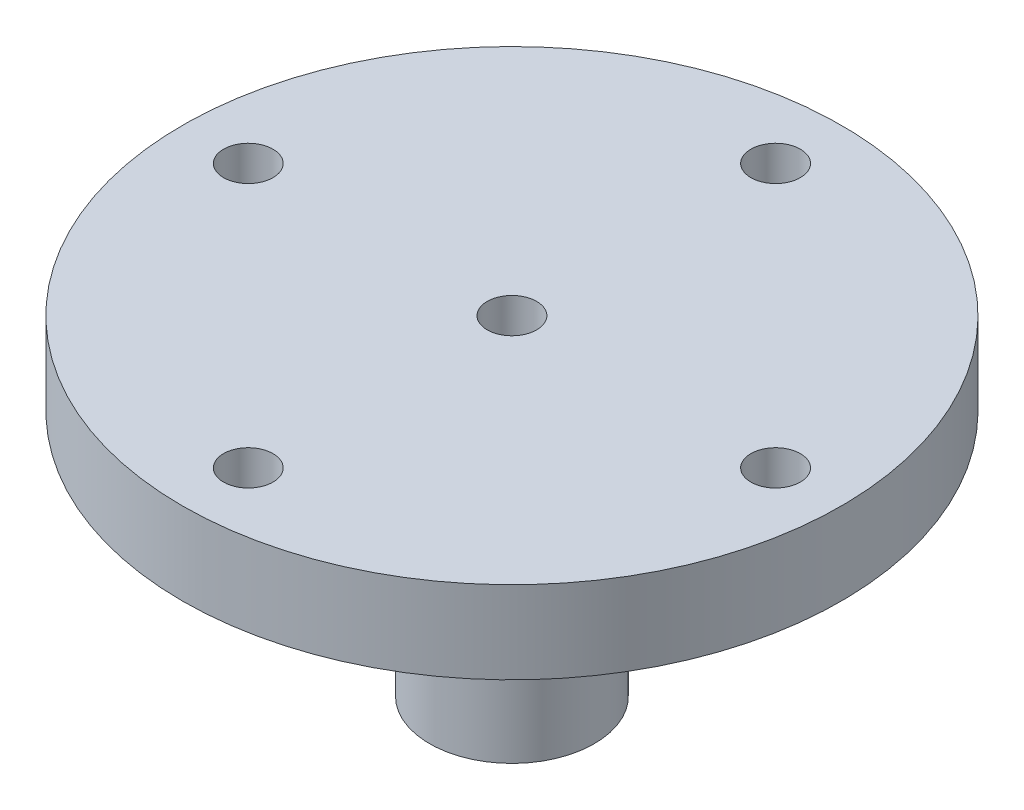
ISO-10303-21;
HEADER;
FILE_DESCRIPTION(('STEP AP214'),'2;1');
FILE_NAME('part.step','',(''),(''),'','','');
FILE_SCHEMA(('AUTOMOTIVE_DESIGN { 1 0 10303 214 1 1 1 1 }'));
ENDSEC;
DATA;
#1=APPLICATION_CONTEXT('core data for automotive mechanical design processes');
#2=APPLICATION_PROTOCOL_DEFINITION('international standard','automotive_design',2000,#1);
#3=PRODUCT_CONTEXT('',#1,'mechanical');
#4=PRODUCT('Part','Part','',(#3));
#5=PRODUCT_RELATED_PRODUCT_CATEGORY('part','',(#4));
#6=PRODUCT_DEFINITION_FORMATION('','',#4);
#7=PRODUCT_DEFINITION_CONTEXT('part definition',#1,'design');
#8=PRODUCT_DEFINITION('design','',#6,#7);
#9=PRODUCT_DEFINITION_SHAPE('','',#8);
#10=(LENGTH_UNIT() NAMED_UNIT(*) SI_UNIT(.MILLI.,.METRE.));
#11=(NAMED_UNIT(*) PLANE_ANGLE_UNIT() SI_UNIT($,.RADIAN.));
#12=(NAMED_UNIT(*) SI_UNIT($,.STERADIAN.) SOLID_ANGLE_UNIT());
#13=UNCERTAINTY_MEASURE_WITH_UNIT(LENGTH_MEASURE(1.E-05),#10,'distance_accuracy_value','');
#14=(GEOMETRIC_REPRESENTATION_CONTEXT(3) GLOBAL_UNCERTAINTY_ASSIGNED_CONTEXT((#13)) GLOBAL_UNIT_ASSIGNED_CONTEXT((#10,
#11,#12)) REPRESENTATION_CONTEXT('',''));
#15=CARTESIAN_POINT('',(0.,0.,0.));
#16=DIRECTION('',(0.,0.,1.));
#17=DIRECTION('',(1.,0.,0.));
#18=AXIS2_PLACEMENT_3D('',#15,#16,#17);
#19=CARTESIAN_POINT('',(0.,5.,0.));
#20=DIRECTION('',(0.,1.,0.));
#21=DIRECTION('',(0.,0.,1.));
#22=AXIS2_PLACEMENT_3D('',#19,#20,#21);
#23=PLANE('',#22);
#24=CARTESIAN_POINT('',(0.,4.99999999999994,0.));
#25=DIRECTION('',(0.,1.,0.));
#26=DIRECTION('',(-1.,0.,0.));
#27=AXIS2_PLACEMENT_3D('',#24,#25,#26);
#28=CIRCLE('',#27,1.5);
#29=CARTESIAN_POINT('',(-1.5,4.99999999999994,0.));
#30=VERTEX_POINT('',#29);
#31=EDGE_CURVE('E76',#30,#30,#28,.F.);
#32=ORIENTED_EDGE('',*,*,#31,.T.);
#33=EDGE_LOOP('',(#32));
#34=FACE_BOUND('',#33,.T.);
#35=CARTESIAN_POINT('',(1.1172740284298E-13,5.,-16.));
#36=DIRECTION('',(0.,1.,0.));
#37=DIRECTION('',(0.,0.,1.));
#38=AXIS2_PLACEMENT_3D('',#35,#36,#37);
#39=CIRCLE('',#38,1.5);
#40=CARTESIAN_POINT('',(1.1172740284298E-13,5.,-14.5));
#41=VERTEX_POINT('',#40);
#42=EDGE_CURVE('E91',#41,#41,#39,.T.);
#43=ORIENTED_EDGE('',*,*,#42,.F.);
#44=EDGE_LOOP('',(#43));
#45=FACE_BOUND('',#44,.T.);
#46=CARTESIAN_POINT('',(0.,5.,16.));
#47=DIRECTION('',(0.,1.,0.));
#48=DIRECTION('',(0.,0.,1.));
#49=AXIS2_PLACEMENT_3D('',#46,#47,#48);
#50=CIRCLE('',#49,1.5);
#51=CARTESIAN_POINT('',(0.,5.,17.5));
#52=VERTEX_POINT('',#51);
#53=EDGE_CURVE('E61',#52,#52,#50,.T.);
#54=ORIENTED_EDGE('',*,*,#53,.F.);
#55=EDGE_LOOP('',(#54));
#56=FACE_BOUND('',#55,.T.);
#57=CARTESIAN_POINT('',(0.,5.,0.));
#58=DIRECTION('',(0.,1.,0.));
#59=DIRECTION('',(0.,0.,1.));
#60=AXIS2_PLACEMENT_3D('',#57,#58,#59);
#61=CIRCLE('',#60,20.);
#62=CARTESIAN_POINT('',(0.,5.,20.));
#63=VERTEX_POINT('',#62);
#64=EDGE_CURVE('E52',#63,#63,#61,.T.);
#65=ORIENTED_EDGE('',*,*,#64,.T.);
#66=EDGE_LOOP('',(#65));
#67=FACE_BOUND('',#66,.T.);
#68=CARTESIAN_POINT('',(-16.,5.,0.));
#69=DIRECTION('',(0.,1.,0.));
#70=DIRECTION('',(0.,0.,1.));
#71=AXIS2_PLACEMENT_3D('',#68,#69,#70);
#72=CIRCLE('',#71,1.5);
#73=CARTESIAN_POINT('',(-16.,5.,1.49999999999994));
#74=VERTEX_POINT('',#73);
#75=EDGE_CURVE('E97',#74,#74,#72,.T.);
#76=ORIENTED_EDGE('',*,*,#75,.F.);
#77=EDGE_LOOP('',(#76));
#78=FACE_BOUND('',#77,.T.);
#79=CARTESIAN_POINT('',(16.,5.,1.6759110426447E-13));
#80=DIRECTION('',(0.,1.,0.));
#81=DIRECTION('',(0.,0.,1.));
#82=AXIS2_PLACEMENT_3D('',#79,#80,#81);
#83=CIRCLE('',#82,1.5);
#84=CARTESIAN_POINT('',(16.,5.,1.50000000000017));
#85=VERTEX_POINT('',#84);
#86=EDGE_CURVE('E85',#85,#85,#83,.T.);
#87=ORIENTED_EDGE('',*,*,#86,.F.);
#88=EDGE_LOOP('',(#87));
#89=FACE_BOUND('',#88,.T.);
#90=ADVANCED_FACE('F45',(#34,#45,#56,#67,#78,#89),#23,.T.);
#91=CARTESIAN_POINT('',(0.,0.,0.));
#92=DIRECTION('',(0.,1.,0.));
#93=DIRECTION('',(0.,0.,1.));
#94=AXIS2_PLACEMENT_3D('',#91,#92,#93);
#95=PLANE('',#94);
#96=CARTESIAN_POINT('',(0.,0.,0.));
#97=DIRECTION('',(0.,1.,0.));
#98=DIRECTION('',(0.,0.,1.));
#99=AXIS2_PLACEMENT_3D('',#96,#97,#98);
#100=CIRCLE('',#99,10.);
#101=CARTESIAN_POINT('',(0.,0.,10.));
#102=VERTEX_POINT('',#101);
#103=EDGE_CURVE('E12',#102,#102,#100,.F.);
#104=ORIENTED_EDGE('',*,*,#103,.F.);
#105=EDGE_LOOP('',(#104));
#106=FACE_BOUND('',#105,.T.);
#107=CARTESIAN_POINT('',(0.,0.,0.));
#108=DIRECTION('',(0.,1.,0.));
#109=DIRECTION('',(0.,0.,1.));
#110=AXIS2_PLACEMENT_3D('',#107,#108,#109);
#111=CIRCLE('',#110,20.);
#112=CARTESIAN_POINT('',(0.,0.,20.));
#113=VERTEX_POINT('',#112);
#114=EDGE_CURVE('E56',#113,#113,#111,.T.);
#115=ORIENTED_EDGE('',*,*,#114,.F.);
#116=EDGE_LOOP('',(#115));
#117=FACE_BOUND('',#116,.T.);
#118=CARTESIAN_POINT('',(0.,0.,16.));
#119=DIRECTION('',(0.,1.,0.));
#120=DIRECTION('',(0.,0.,1.));
#121=AXIS2_PLACEMENT_3D('',#118,#119,#120);
#122=CIRCLE('',#121,1.5);
#123=CARTESIAN_POINT('',(0.,0.,17.5));
#124=VERTEX_POINT('',#123);
#125=EDGE_CURVE('E64',#124,#124,#122,.T.);
#126=ORIENTED_EDGE('',*,*,#125,.T.);
#127=EDGE_LOOP('',(#126));
#128=FACE_BOUND('',#127,.T.);
#129=CARTESIAN_POINT('',(-16.,0.,0.));
#130=DIRECTION('',(0.,1.,0.));
#131=DIRECTION('',(0.,0.,1.));
#132=AXIS2_PLACEMENT_3D('',#129,#130,#131);
#133=CIRCLE('',#132,1.5);
#134=CARTESIAN_POINT('',(-16.,0.,1.49999999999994));
#135=VERTEX_POINT('',#134);
#136=EDGE_CURVE('E94',#135,#135,#133,.T.);
#137=ORIENTED_EDGE('',*,*,#136,.T.);
#138=EDGE_LOOP('',(#137));
#139=FACE_BOUND('',#138,.T.);
#140=CARTESIAN_POINT('',(1.1172740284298E-13,0.,-16.));
#141=DIRECTION('',(0.,1.,0.));
#142=DIRECTION('',(0.,0.,1.));
#143=AXIS2_PLACEMENT_3D('',#140,#141,#142);
#144=CIRCLE('',#143,1.5);
#145=CARTESIAN_POINT('',(1.1172740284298E-13,0.,-14.5));
#146=VERTEX_POINT('',#145);
#147=EDGE_CURVE('E88',#146,#146,#144,.T.);
#148=ORIENTED_EDGE('',*,*,#147,.T.);
#149=EDGE_LOOP('',(#148));
#150=FACE_BOUND('',#149,.T.);
#151=CARTESIAN_POINT('',(16.,0.,1.6759110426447E-13));
#152=DIRECTION('',(0.,1.,0.));
#153=DIRECTION('',(0.,0.,1.));
#154=AXIS2_PLACEMENT_3D('',#151,#152,#153);
#155=CIRCLE('',#154,1.5);
#156=CARTESIAN_POINT('',(16.,0.,1.50000000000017));
#157=VERTEX_POINT('',#156);
#158=EDGE_CURVE('E73',#157,#157,#155,.T.);
#159=ORIENTED_EDGE('',*,*,#158,.T.);
#160=EDGE_LOOP('',(#159));
#161=FACE_BOUND('',#160,.T.);
#162=ADVANCED_FACE('F107',(#106,#117,#128,#139,#150,#161),#95,.F.);
#163=CARTESIAN_POINT('',(0.,5.,0.));
#164=DIRECTION('',(0.,-1.,0.));
#165=DIRECTION('',(0.,0.,-1.));
#166=AXIS2_PLACEMENT_3D('',#163,#164,#165);
#167=CYLINDRICAL_SURFACE('',#166,20.);
#168=ORIENTED_EDGE('',*,*,#64,.F.);
#169=EDGE_LOOP('',(#168));
#170=FACE_BOUND('',#169,.T.);
#171=ORIENTED_EDGE('',*,*,#114,.T.);
#172=EDGE_LOOP('',(#171));
#173=FACE_BOUND('',#172,.T.);
#174=ADVANCED_FACE('F47',(#170,#173),#167,.T.);
#175=CARTESIAN_POINT('',(0.,5.,16.));
#176=DIRECTION('',(0.,-1.,0.));
#177=DIRECTION('',(0.,0.,-1.));
#178=AXIS2_PLACEMENT_3D('',#175,#176,#177);
#179=CYLINDRICAL_SURFACE('',#178,1.5);
#180=ORIENTED_EDGE('',*,*,#53,.T.);
#181=EDGE_LOOP('',(#180));
#182=FACE_BOUND('',#181,.T.);
#183=ORIENTED_EDGE('',*,*,#125,.F.);
#184=EDGE_LOOP('',(#183));
#185=FACE_BOUND('',#184,.T.);
#186=ADVANCED_FACE('F110',(#182,#185),#179,.F.);
#187=CARTESIAN_POINT('',(-16.,5.,0.));
#188=DIRECTION('',(0.,-1.,0.));
#189=DIRECTION('',(0.,0.,-1.));
#190=AXIS2_PLACEMENT_3D('',#187,#188,#189);
#191=CYLINDRICAL_SURFACE('',#190,1.5);
#192=ORIENTED_EDGE('',*,*,#75,.T.);
#193=EDGE_LOOP('',(#192));
#194=FACE_BOUND('',#193,.T.);
#195=ORIENTED_EDGE('',*,*,#136,.F.);
#196=EDGE_LOOP('',(#195));
#197=FACE_BOUND('',#196,.T.);
#198=ADVANCED_FACE('F112',(#194,#197),#191,.F.);
#199=CARTESIAN_POINT('',(1.1172740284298E-13,5.,-16.));
#200=DIRECTION('',(0.,-1.,0.));
#201=DIRECTION('',(0.,0.,-1.));
#202=AXIS2_PLACEMENT_3D('',#199,#200,#201);
#203=CYLINDRICAL_SURFACE('',#202,1.5);
#204=ORIENTED_EDGE('',*,*,#42,.T.);
#205=EDGE_LOOP('',(#204));
#206=FACE_BOUND('',#205,.T.);
#207=ORIENTED_EDGE('',*,*,#147,.F.);
#208=EDGE_LOOP('',(#207));
#209=FACE_BOUND('',#208,.T.);
#210=ADVANCED_FACE('F118',(#206,#209),#203,.F.);
#211=CARTESIAN_POINT('',(16.,5.,1.6759110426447E-13));
#212=DIRECTION('',(0.,-1.,0.));
#213=DIRECTION('',(0.,0.,-1.));
#214=AXIS2_PLACEMENT_3D('',#211,#212,#213);
#215=CYLINDRICAL_SURFACE('',#214,1.5);
#216=ORIENTED_EDGE('',*,*,#86,.T.);
#217=EDGE_LOOP('',(#216));
#218=FACE_BOUND('',#217,.T.);
#219=ORIENTED_EDGE('',*,*,#158,.F.);
#220=EDGE_LOOP('',(#219));
#221=FACE_BOUND('',#220,.T.);
#222=ADVANCED_FACE('F138',(#218,#221),#215,.F.);
#223=CARTESIAN_POINT('',(0.,-3.,0.));
#224=DIRECTION('',(0.,1.,0.));
#225=DIRECTION('',(0.,0.,1.));
#226=AXIS2_PLACEMENT_3D('',#223,#224,#225);
#227=CYLINDRICAL_SURFACE('',#226,10.);
#228=CARTESIAN_POINT('',(0.,-3.,0.));
#229=DIRECTION('',(0.,-1.,0.));
#230=DIRECTION('',(0.,0.,-1.));
#231=AXIS2_PLACEMENT_3D('',#228,#229,#230);
#232=CIRCLE('',#231,10.);
#233=CARTESIAN_POINT('',(0.,-3.,-10.));
#234=VERTEX_POINT('',#233);
#235=EDGE_CURVE('E69',#234,#234,#232,.T.);
#236=ORIENTED_EDGE('',*,*,#235,.F.);
#237=EDGE_LOOP('',(#236));
#238=FACE_BOUND('',#237,.T.);
#239=ORIENTED_EDGE('',*,*,#103,.T.);
#240=EDGE_LOOP('',(#239));
#241=FACE_BOUND('',#240,.T.);
#242=ADVANCED_FACE('F141',(#238,#241),#227,.T.);
#243=CARTESIAN_POINT('',(0.,-3.,0.));
#244=DIRECTION('',(0.,-1.,0.));
#245=DIRECTION('',(0.,0.,-1.));
#246=AXIS2_PLACEMENT_3D('',#243,#244,#245);
#247=PLANE('',#246);
#248=CARTESIAN_POINT('',(0.,-3.,0.));
#249=DIRECTION('',(0.,-1.,0.));
#250=DIRECTION('',(0.,0.,-1.));
#251=AXIS2_PLACEMENT_3D('',#248,#249,#250);
#252=CIRCLE('',#251,5.);
#253=CARTESIAN_POINT('',(0.,-3.,-5.));
#254=VERTEX_POINT('',#253);
#255=EDGE_CURVE('E66',#254,#254,#252,.T.);
#256=ORIENTED_EDGE('',*,*,#255,.F.);
#257=EDGE_LOOP('',(#256));
#258=FACE_BOUND('',#257,.T.);
#259=ORIENTED_EDGE('',*,*,#235,.T.);
#260=EDGE_LOOP('',(#259));
#261=FACE_BOUND('',#260,.T.);
#262=ADVANCED_FACE('F149',(#258,#261),#247,.T.);
#263=CARTESIAN_POINT('',(0.,-15.,0.));
#264=DIRECTION('',(0.,-1.,0.));
#265=DIRECTION('',(0.,0.,-1.));
#266=AXIS2_PLACEMENT_3D('',#263,#264,#265);
#267=PLANE('',#266);
#268=CARTESIAN_POINT('',(0.,-15.,0.));
#269=DIRECTION('',(0.,-1.,0.));
#270=DIRECTION('',(0.,0.,-1.));
#271=AXIS2_PLACEMENT_3D('',#268,#269,#270);
#272=CIRCLE('',#271,1.5);
#273=CARTESIAN_POINT('',(0.,-15.,-1.5));
#274=VERTEX_POINT('',#273);
#275=EDGE_CURVE('E81',#274,#274,#272,.T.);
#276=ORIENTED_EDGE('',*,*,#275,.F.);
#277=EDGE_LOOP('',(#276));
#278=FACE_BOUND('',#277,.T.);
#279=CARTESIAN_POINT('',(0.,-15.,0.));
#280=DIRECTION('',(0.,-1.,0.));
#281=DIRECTION('',(0.,0.,-1.));
#282=AXIS2_PLACEMENT_3D('',#279,#280,#281);
#283=CIRCLE('',#282,5.);
#284=CARTESIAN_POINT('',(0.,-15.,-5.));
#285=VERTEX_POINT('',#284);
#286=EDGE_CURVE('E68',#285,#285,#283,.T.);
#287=ORIENTED_EDGE('',*,*,#286,.T.);
#288=EDGE_LOOP('',(#287));
#289=FACE_BOUND('',#288,.T.);
#290=ADVANCED_FACE('F159',(#278,#289),#267,.T.);
#291=CARTESIAN_POINT('',(0.,-15.,0.));
#292=DIRECTION('',(0.,1.,0.));
#293=DIRECTION('',(0.,0.,1.));
#294=AXIS2_PLACEMENT_3D('',#291,#292,#293);
#295=CYLINDRICAL_SURFACE('',#294,5.);
#296=ORIENTED_EDGE('',*,*,#255,.T.);
#297=EDGE_LOOP('',(#296));
#298=FACE_BOUND('',#297,.T.);
#299=ORIENTED_EDGE('',*,*,#286,.F.);
#300=EDGE_LOOP('',(#299));
#301=FACE_BOUND('',#300,.T.);
#302=ADVANCED_FACE('F155',(#298,#301),#295,.T.);
#303=CARTESIAN_POINT('',(0.,9.24264068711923,0.));
#304=DIRECTION('',(0.,-1.,0.));
#305=DIRECTION('',(0.,0.,-1.));
#306=AXIS2_PLACEMENT_3D('',#303,#304,#305);
#307=CYLINDRICAL_SURFACE('',#306,1.5);
#308=ORIENTED_EDGE('',*,*,#275,.T.);
#309=EDGE_LOOP('',(#308));
#310=FACE_BOUND('',#309,.T.);
#311=ORIENTED_EDGE('',*,*,#31,.F.);
#312=EDGE_LOOP('',(#311));
#313=FACE_BOUND('',#312,.T.);
#314=ADVANCED_FACE('F158',(#310,#313),#307,.F.);
#315=CLOSED_SHELL('',(#90,#162,#174,#186,#198,#210,#222,#242,#262,#290,#302,#314));
#316=MANIFOLD_SOLID_BREP('B2',#315);
#317=ADVANCED_BREP_SHAPE_REPRESENTATION('',(#18,#316),#14);
#318=SHAPE_DEFINITION_REPRESENTATION(#9,#317);
ENDSEC;
END-ISO-10303-21;
